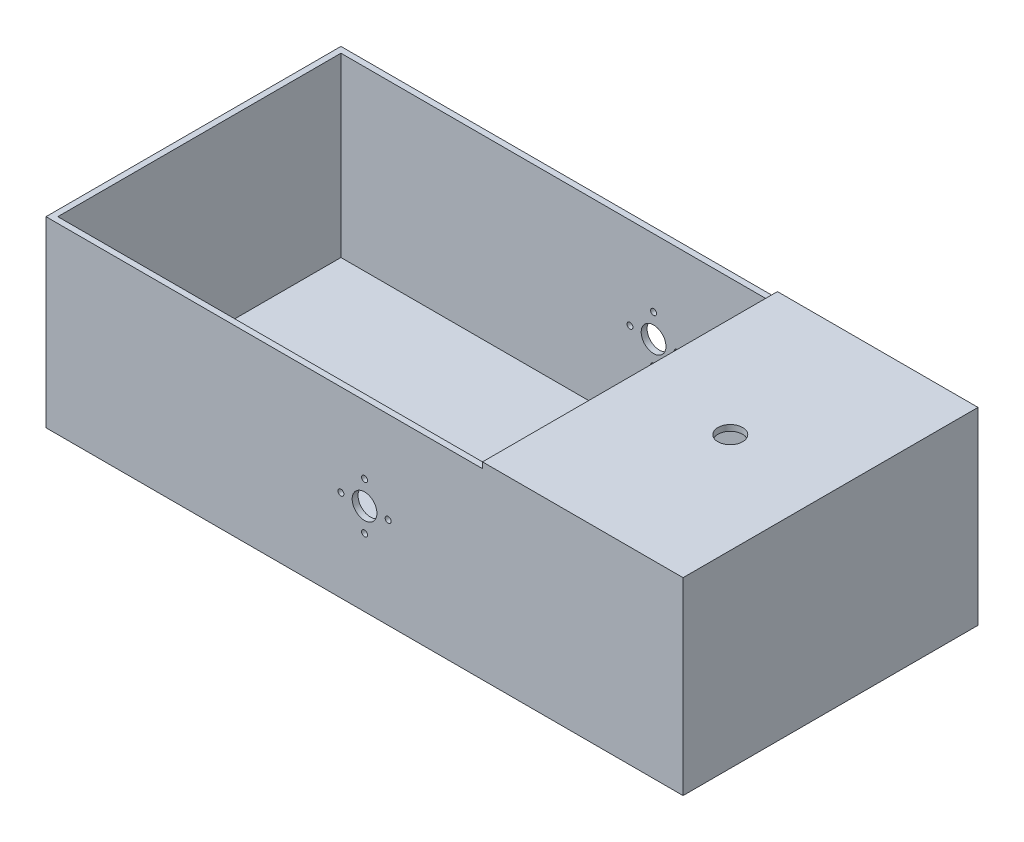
from build123d import *

# Parameters (mm, degrees)
SKETCH1_W           = 540
SKETCH1_H           = 250
BOSS_EXTRUDE1_DEPTH = 5
SKETCH2_W           = 540
SKETCH2_H           = 250
SKETCH2_W_2         = 530
SKETCH2_H_2         = 240
BOSS_EXTRUDE2_DEPTH = 150
SKETCH3_W           = 170
SKETCH3_H           = 250
BOSS_EXTRUDE3_DEPTH = 5
SKETCH5_R           = 10.5
CUT_EXTRUDE1_DEPTH  = 10
SKETCH7_R           = 10.5
SKETCH7_R_2         = 2.5
CUT_EXTRUDE2_DEPTH  = 402.248052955


with BuildPart() as part:
    # Sketch1 → Boss-Extrude1 (new body)
    with BuildSketch(Plane(origin=(0, 0, 0), x_dir=(1, 0, 0), z_dir=(0, 1, 0))):
        Rectangle(SKETCH1_W, SKETCH1_H)
    extrude(amount=BOSS_EXTRUDE1_DEPTH)

    # Sketch2 → Boss-Extrude2 (add)
    with BuildSketch(Plane(origin=(0, 5, 0), x_dir=(1, 0, 0), z_dir=(0, 1, 0))):
        Rectangle(SKETCH2_W, SKETCH2_H)
        Rectangle(SKETCH2_W_2, SKETCH2_H_2, mode=Mode.SUBTRACT)
    extrude(amount=BOSS_EXTRUDE2_DEPTH)

    # Sketch3 → Boss-Extrude3 (add)
    with BuildSketch(Plane(origin=(0, 155, 0), x_dir=(1, 0, 0), z_dir=(0, 1, 0))):
        with Locations((185, 0)):
            Rectangle(SKETCH3_W, SKETCH3_H)
    extrude(amount=BOSS_EXTRUDE3_DEPTH)

    # Sketch5 → Cut-Extrude1 (cut)
    with BuildSketch(Plane(origin=(0, 160, 0), x_dir=(1, 0, 0), z_dir=(0, 1, 0))):
        with Locations(Location((185, 0, 0), (0, 0, 270))):
            Circle(SKETCH5_R)
    extrude(amount=-CUT_EXTRUDE1_DEPTH, mode=Mode.SUBTRACT)

    # Sketch7 → Cut-Extrude2 (cut, through all)
    with BuildSketch(Plane.XY.offset(125)):
        with Locations((0, 77.5)):
            Circle(SKETCH7_R)
        with Locations((0, 97.5)):
            Circle(SKETCH7_R_2)
        with Locations((20, 77.5)):
            Circle(SKETCH7_R_2)
        with Locations((-20, 77.5)):
            Circle(SKETCH7_R_2)
        with Locations((0, 57.5)):
            Circle(SKETCH7_R_2)
    extrude(amount=-CUT_EXTRUDE2_DEPTH, mode=Mode.SUBTRACT)


solid = part.part
